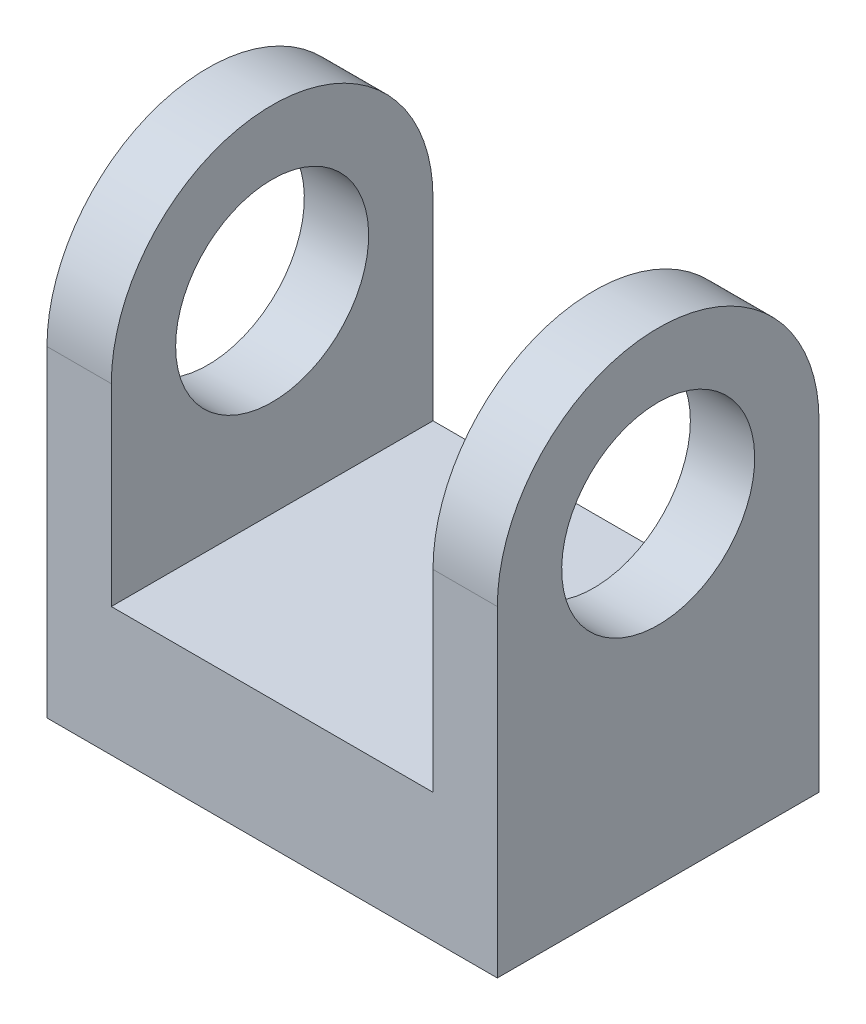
from build123d import *

# Parameters (mm, degrees)
EXTRUDE1_DEPTH     = 25
FILLET1_RADIUS     = 25
FILLET1_LENGTH     = 10
FILLET2_RADIUS     = 25
FILLET2_LENGTH     = 10
SKETCH2_R          = 15
CUT_EXTRUDE1_DEPTH = 93.466210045


with BuildPart() as part:
    # Sketch1 → Extrude1 (new, symmetric)
    with BuildSketch(Plane.XY):
        Polygon((25, 0), (25, 55), (35, 55), (35, -20), (-35, -20), (-35, 55), (-25, 55), (-25, 0), (0, 0), align=None)
    extrude(amount=EXTRUDE1_DEPTH, both=True)

    # Fillet1: full round fillet: the end face becomes a half cylinder, R = half its width
    fillet1_face = Plane((30, 55, 0), x_dir=(1, 0, 0), z_dir=(0, 1, 0))  # on the end face: x along it, z out of the body
    fillet1_slab = fillet1_face.offset(-FILLET1_RADIUS / 2) * Box(FILLET1_LENGTH, 2 * FILLET1_RADIUS, FILLET1_RADIUS, mode=Mode.PRIVATE)  # the body's end, R deep
    fillet1_round = Plane((30, 30, 0), x_dir=(0, 1, 0), z_dir=(1, 0, 0)) * Cylinder(FILLET1_RADIUS, FILLET1_LENGTH, mode=Mode.PRIVATE)  # its axis R under the face
    add(fillet1_slab - fillet1_round, mode=Mode.SUBTRACT)

    # Fillet2: full round fillet: the end face becomes a half cylinder, R = half its width
    fillet2_face = Plane((-30, 55, 0), x_dir=(1, 0, 0), z_dir=(0, 1, 0))  # on the end face: x along it, z out of the body
    fillet2_slab = fillet2_face.offset(-FILLET2_RADIUS / 2) * Box(FILLET2_LENGTH, 2 * FILLET2_RADIUS, FILLET2_RADIUS, mode=Mode.PRIVATE)  # the body's end, R deep
    fillet2_round = Plane((-30, 30, 0), x_dir=(0, 1, 0), z_dir=(1, 0, 0)) * Cylinder(FILLET2_RADIUS, FILLET2_LENGTH, mode=Mode.PRIVATE)  # its axis R under the face
    add(fillet2_slab - fillet2_round, mode=Mode.SUBTRACT)

    # Sketch2 → Cut-Extrude1 (cut, through all)
    with BuildSketch(Plane(origin=(35, 0, 0), x_dir=(0, 0, -1), z_dir=(1, 0, 0))):
        with Locations(Location((0, 30, 0), (0, 0, 90))):
            Circle(SKETCH2_R)
    extrude(amount=-CUT_EXTRUDE1_DEPTH, mode=Mode.SUBTRACT)


solid = part.part
